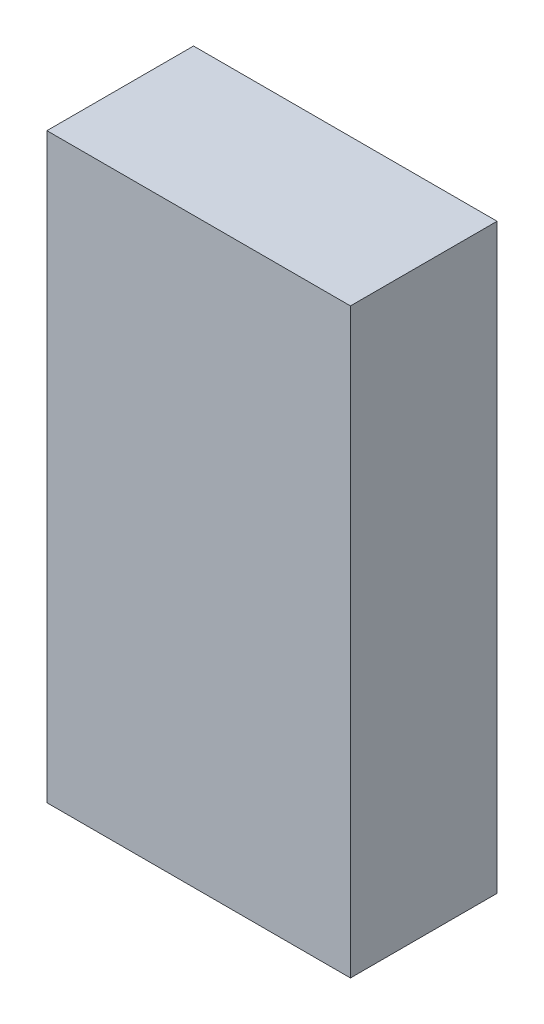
ISO-10303-21;
HEADER;
FILE_DESCRIPTION(('STEP AP214'),'2;1');
FILE_NAME('part.step','',(''),(''),'','','');
FILE_SCHEMA(('AUTOMOTIVE_DESIGN { 1 0 10303 214 1 1 1 1 }'));
ENDSEC;
DATA;
#1=APPLICATION_CONTEXT('core data for automotive mechanical design processes');
#2=APPLICATION_PROTOCOL_DEFINITION('international standard','automotive_design',2000,#1);
#3=PRODUCT_CONTEXT('',#1,'mechanical');
#4=PRODUCT('Part','Part','',(#3));
#5=PRODUCT_RELATED_PRODUCT_CATEGORY('part','',(#4));
#6=PRODUCT_DEFINITION_FORMATION('','',#4);
#7=PRODUCT_DEFINITION_CONTEXT('part definition',#1,'design');
#8=PRODUCT_DEFINITION('design','',#6,#7);
#9=PRODUCT_DEFINITION_SHAPE('','',#8);
#10=(LENGTH_UNIT() NAMED_UNIT(*) SI_UNIT(.MILLI.,.METRE.));
#11=(NAMED_UNIT(*) PLANE_ANGLE_UNIT() SI_UNIT($,.RADIAN.));
#12=(NAMED_UNIT(*) SI_UNIT($,.STERADIAN.) SOLID_ANGLE_UNIT());
#13=UNCERTAINTY_MEASURE_WITH_UNIT(LENGTH_MEASURE(1.E-05),#10,'distance_accuracy_value','');
#14=(GEOMETRIC_REPRESENTATION_CONTEXT(3) GLOBAL_UNCERTAINTY_ASSIGNED_CONTEXT((#13)) GLOBAL_UNIT_ASSIGNED_CONTEXT((#10,
#11,#12)) REPRESENTATION_CONTEXT('',''));
#15=CARTESIAN_POINT('',(0.,0.,0.));
#16=DIRECTION('',(0.,0.,1.));
#17=DIRECTION('',(1.,0.,0.));
#18=AXIS2_PLACEMENT_3D('',#15,#16,#17);
#19=CARTESIAN_POINT('',(719.701105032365,-1151.96925283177,0.));
#20=DIRECTION('',(0.,0.,-1.));
#21=DIRECTION('',(-1.,0.,0.));
#22=AXIS2_PLACEMENT_3D('',#19,#20,#21);
#23=PLANE('',#22);
#24=DIRECTION('',(0.,1.,0.));
#25=VECTOR('',#24,1.);
#26=CARTESIAN_POINT('',(719.701105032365,-1151.23265283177,0.));
#27=LINE('',#26,#25);
#28=CARTESIAN_POINT('',(719.701105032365,-1151.96925283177,0.));
#29=VERTEX_POINT('',#28);
#30=CARTESIAN_POINT('',(719.701105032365,-72.4960528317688,0.));
#31=VERTEX_POINT('',#30);
#32=EDGE_CURVE('E144',#29,#31,#27,.T.);
#33=ORIENTED_EDGE('',*,*,#32,.F.);
#34=DIRECTION('',(1.,0.,0.));
#35=VECTOR('',#34,1.);
#36=CARTESIAN_POINT('',(718.964505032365,-1151.96925283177,0.));
#37=LINE('',#36,#35);
#38=CARTESIAN_POINT('',(156.767905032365,-1151.96925283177,0.));
#39=VERTEX_POINT('',#38);
#40=EDGE_CURVE('E45',#39,#29,#37,.T.);
#41=ORIENTED_EDGE('',*,*,#40,.F.);
#42=DIRECTION('',(0.,-1.,0.));
#43=VECTOR('',#42,1.);
#44=CARTESIAN_POINT('',(156.767905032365,-1151.23265283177,0.));
#45=LINE('',#44,#43);
#46=CARTESIAN_POINT('',(156.767905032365,-72.4960528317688,0.));
#47=VERTEX_POINT('',#46);
#48=EDGE_CURVE('E148',#47,#39,#45,.T.);
#49=ORIENTED_EDGE('',*,*,#48,.F.);
#50=DIRECTION('',(-1.,0.,0.));
#51=VECTOR('',#50,1.);
#52=CARTESIAN_POINT('',(718.964505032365,-72.4960528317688,0.));
#53=LINE('',#52,#51);
#54=EDGE_CURVE('E94',#31,#47,#53,.T.);
#55=ORIENTED_EDGE('',*,*,#54,.F.);
#56=EDGE_LOOP('',(#33,#41,#49,#55));
#57=FACE_BOUND('',#56,.T.);
#58=DIRECTION('',(1.,0.,0.));
#59=VECTOR('',#58,1.);
#60=CARTESIAN_POINT('',(718.964505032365,-1151.23265283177,0.));
#61=LINE('',#60,#59);
#62=CARTESIAN_POINT('',(157.504505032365,-1151.23265283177,0.));
#63=VERTEX_POINT('',#62);
#64=CARTESIAN_POINT('',(718.964505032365,-1151.23265283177,0.));
#65=VERTEX_POINT('',#64);
#66=EDGE_CURVE('E121',#63,#65,#61,.T.);
#67=ORIENTED_EDGE('',*,*,#66,.T.);
#68=DIRECTION('',(0.,1.,0.));
#69=VECTOR('',#68,1.);
#70=CARTESIAN_POINT('',(718.964505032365,-1151.23265283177,0.));
#71=LINE('',#70,#69);
#72=CARTESIAN_POINT('',(718.964505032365,-73.2326528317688,0.));
#73=VERTEX_POINT('',#72);
#74=EDGE_CURVE('E37',#65,#73,#71,.T.);
#75=ORIENTED_EDGE('',*,*,#74,.T.);
#76=DIRECTION('',(-1.,0.,0.));
#77=VECTOR('',#76,1.);
#78=CARTESIAN_POINT('',(718.964505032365,-73.2326528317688,0.));
#79=LINE('',#78,#77);
#80=CARTESIAN_POINT('',(157.504505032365,-73.2326528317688,0.));
#81=VERTEX_POINT('',#80);
#82=EDGE_CURVE('E115',#73,#81,#79,.T.);
#83=ORIENTED_EDGE('',*,*,#82,.T.);
#84=DIRECTION('',(0.,-1.,0.));
#85=VECTOR('',#84,1.);
#86=CARTESIAN_POINT('',(157.504505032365,-1151.23265283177,0.));
#87=LINE('',#86,#85);
#88=EDGE_CURVE('E118',#81,#63,#87,.T.);
#89=ORIENTED_EDGE('',*,*,#88,.T.);
#90=EDGE_LOOP('',(#67,#75,#83,#89));
#91=FACE_BOUND('',#90,.T.);
#92=ADVANCED_FACE('F22',(#57,#91),#23,.T.);
#93=CARTESIAN_POINT('',(719.701105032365,-1151.23265283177,271.196193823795));
#94=DIRECTION('',(-1.,0.,0.));
#95=DIRECTION('',(0.,0.,1.));
#96=AXIS2_PLACEMENT_3D('',#93,#94,#95);
#97=PLANE('',#96);
#98=ORIENTED_EDGE('',*,*,#32,.T.);
#99=DIRECTION('',(0.,0.,-1.));
#100=VECTOR('',#99,1.);
#101=CARTESIAN_POINT('',(719.701105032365,-72.4960528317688,271.196193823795));
#102=LINE('',#101,#100);
#103=CARTESIAN_POINT('',(719.701105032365,-72.4960528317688,271.932793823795));
#104=VERTEX_POINT('',#103);
#105=EDGE_CURVE('E11',#104,#31,#102,.T.);
#106=ORIENTED_EDGE('',*,*,#105,.F.);
#107=DIRECTION('',(0.,1.,0.));
#108=VECTOR('',#107,1.);
#109=CARTESIAN_POINT('',(719.701105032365,-1151.96925283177,271.932793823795));
#110=LINE('',#109,#108);
#111=CARTESIAN_POINT('',(719.701105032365,-1151.96925283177,271.932793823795));
#112=VERTEX_POINT('',#111);
#113=EDGE_CURVE('E109',#112,#104,#110,.T.);
#114=ORIENTED_EDGE('',*,*,#113,.F.);
#115=DIRECTION('',(0.,0.,-1.));
#116=VECTOR('',#115,1.);
#117=CARTESIAN_POINT('',(719.701105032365,-1151.96925283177,271.196193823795));
#118=LINE('',#117,#116);
#119=EDGE_CURVE('E151',#112,#29,#118,.T.);
#120=ORIENTED_EDGE('',*,*,#119,.T.);
#121=EDGE_LOOP('',(#98,#106,#114,#120));
#122=FACE_BOUND('',#121,.T.);
#123=ADVANCED_FACE('F24',(#122),#97,.F.);
#124=CARTESIAN_POINT('',(718.964505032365,-72.4960528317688,271.196193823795));
#125=DIRECTION('',(0.,-1.,0.));
#126=DIRECTION('',(1.,0.,0.));
#127=AXIS2_PLACEMENT_3D('',#124,#125,#126);
#128=PLANE('',#127);
#129=ORIENTED_EDGE('',*,*,#54,.T.);
#130=DIRECTION('',(0.,0.,-1.));
#131=VECTOR('',#130,1.);
#132=CARTESIAN_POINT('',(156.767905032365,-72.4960528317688,271.196193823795));
#133=LINE('',#132,#131);
#134=CARTESIAN_POINT('',(156.767905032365,-72.4960528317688,271.932793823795));
#135=VERTEX_POINT('',#134);
#136=EDGE_CURVE('E30',#135,#47,#133,.T.);
#137=ORIENTED_EDGE('',*,*,#136,.F.);
#138=DIRECTION('',(-1.,0.,0.));
#139=VECTOR('',#138,1.);
#140=CARTESIAN_POINT('',(719.701105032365,-72.4960528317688,271.932793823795));
#141=LINE('',#140,#139);
#142=EDGE_CURVE('E93',#104,#135,#141,.T.);
#143=ORIENTED_EDGE('',*,*,#142,.F.);
#144=ORIENTED_EDGE('',*,*,#105,.T.);
#145=EDGE_LOOP('',(#129,#137,#143,#144));
#146=FACE_BOUND('',#145,.T.);
#147=ADVANCED_FACE('F91',(#146),#128,.F.);
#148=CARTESIAN_POINT('',(156.767905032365,-1151.23265283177,271.196193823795));
#149=DIRECTION('',(1.,0.,0.));
#150=DIRECTION('',(0.,0.,-1.));
#151=AXIS2_PLACEMENT_3D('',#148,#149,#150);
#152=PLANE('',#151);
#153=ORIENTED_EDGE('',*,*,#48,.T.);
#154=DIRECTION('',(0.,0.,-1.));
#155=VECTOR('',#154,1.);
#156=CARTESIAN_POINT('',(156.767905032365,-1151.96925283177,271.196193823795));
#157=LINE('',#156,#155);
#158=CARTESIAN_POINT('',(156.767905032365,-1151.96925283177,271.932793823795));
#159=VERTEX_POINT('',#158);
#160=EDGE_CURVE('E97',#159,#39,#157,.T.);
#161=ORIENTED_EDGE('',*,*,#160,.F.);
#162=DIRECTION('',(0.,-1.,0.));
#163=VECTOR('',#162,1.);
#164=CARTESIAN_POINT('',(156.767905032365,-72.4960528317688,271.932793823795));
#165=LINE('',#164,#163);
#166=EDGE_CURVE('E99',#135,#159,#165,.T.);
#167=ORIENTED_EDGE('',*,*,#166,.F.);
#168=ORIENTED_EDGE('',*,*,#136,.T.);
#169=EDGE_LOOP('',(#153,#161,#167,#168));
#170=FACE_BOUND('',#169,.T.);
#171=ADVANCED_FACE('F100',(#170),#152,.F.);
#172=CARTESIAN_POINT('',(718.964505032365,-1151.96925283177,271.196193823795));
#173=DIRECTION('',(0.,1.,0.));
#174=DIRECTION('',(0.,0.,1.));
#175=AXIS2_PLACEMENT_3D('',#172,#173,#174);
#176=PLANE('',#175);
#177=ORIENTED_EDGE('',*,*,#40,.T.);
#178=ORIENTED_EDGE('',*,*,#119,.F.);
#179=DIRECTION('',(1.,0.,0.));
#180=VECTOR('',#179,1.);
#181=CARTESIAN_POINT('',(156.767905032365,-1151.96925283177,271.932793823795));
#182=LINE('',#181,#180);
#183=EDGE_CURVE('E104',#159,#112,#182,.T.);
#184=ORIENTED_EDGE('',*,*,#183,.F.);
#185=ORIENTED_EDGE('',*,*,#160,.T.);
#186=EDGE_LOOP('',(#177,#178,#184,#185));
#187=FACE_BOUND('',#186,.T.);
#188=ADVANCED_FACE('F153',(#187),#176,.F.);
#189=CARTESIAN_POINT('',(718.964505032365,-1151.23265283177,271.196193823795));
#190=DIRECTION('',(-1.,0.,0.));
#191=DIRECTION('',(0.,0.,1.));
#192=AXIS2_PLACEMENT_3D('',#189,#190,#191);
#193=PLANE('',#192);
#194=ORIENTED_EDGE('',*,*,#74,.F.);
#195=DIRECTION('',(0.,0.,-1.));
#196=VECTOR('',#195,1.);
#197=CARTESIAN_POINT('',(718.964505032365,-1151.23265283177,271.196193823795));
#198=LINE('',#197,#196);
#199=CARTESIAN_POINT('',(718.964505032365,-1151.23265283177,271.196193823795));
#200=VERTEX_POINT('',#199);
#201=EDGE_CURVE('E136',#200,#65,#198,.T.);
#202=ORIENTED_EDGE('',*,*,#201,.F.);
#203=DIRECTION('',(0.,1.,0.));
#204=VECTOR('',#203,1.);
#205=CARTESIAN_POINT('',(718.964505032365,-1151.23265283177,271.196193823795));
#206=LINE('',#205,#204);
#207=CARTESIAN_POINT('',(718.964505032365,-73.2326528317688,271.196193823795));
#208=VERTEX_POINT('',#207);
#209=EDGE_CURVE('E124',#200,#208,#206,.T.);
#210=ORIENTED_EDGE('',*,*,#209,.T.);
#211=DIRECTION('',(0.,0.,-1.));
#212=VECTOR('',#211,1.);
#213=CARTESIAN_POINT('',(718.964505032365,-73.2326528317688,271.196193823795));
#214=LINE('',#213,#212);
#215=EDGE_CURVE('E142',#208,#73,#214,.T.);
#216=ORIENTED_EDGE('',*,*,#215,.T.);
#217=EDGE_LOOP('',(#194,#202,#210,#216));
#218=FACE_BOUND('',#217,.T.);
#219=ADVANCED_FACE('F170',(#218),#193,.T.);
#220=CARTESIAN_POINT('',(718.964505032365,-73.2326528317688,271.196193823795));
#221=DIRECTION('',(0.,-1.,0.));
#222=DIRECTION('',(1.,0.,0.));
#223=AXIS2_PLACEMENT_3D('',#220,#221,#222);
#224=PLANE('',#223);
#225=ORIENTED_EDGE('',*,*,#82,.F.);
#226=ORIENTED_EDGE('',*,*,#215,.F.);
#227=DIRECTION('',(-1.,0.,0.));
#228=VECTOR('',#227,1.);
#229=CARTESIAN_POINT('',(718.964505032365,-73.2326528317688,271.196193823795));
#230=LINE('',#229,#228);
#231=CARTESIAN_POINT('',(157.504505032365,-73.2326528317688,271.196193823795));
#232=VERTEX_POINT('',#231);
#233=EDGE_CURVE('E127',#208,#232,#230,.T.);
#234=ORIENTED_EDGE('',*,*,#233,.T.);
#235=DIRECTION('',(0.,0.,-1.));
#236=VECTOR('',#235,1.);
#237=CARTESIAN_POINT('',(157.504505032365,-73.2326528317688,271.196193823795));
#238=LINE('',#237,#236);
#239=EDGE_CURVE('E140',#232,#81,#238,.T.);
#240=ORIENTED_EDGE('',*,*,#239,.T.);
#241=EDGE_LOOP('',(#225,#226,#234,#240));
#242=FACE_BOUND('',#241,.T.);
#243=ADVANCED_FACE('F205',(#242),#224,.T.);
#244=CARTESIAN_POINT('',(157.504505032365,-1151.23265283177,271.196193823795));
#245=DIRECTION('',(1.,0.,0.));
#246=DIRECTION('',(0.,0.,-1.));
#247=AXIS2_PLACEMENT_3D('',#244,#245,#246);
#248=PLANE('',#247);
#249=ORIENTED_EDGE('',*,*,#88,.F.);
#250=ORIENTED_EDGE('',*,*,#239,.F.);
#251=DIRECTION('',(0.,-1.,0.));
#252=VECTOR('',#251,1.);
#253=CARTESIAN_POINT('',(157.504505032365,-1151.23265283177,271.196193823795));
#254=LINE('',#253,#252);
#255=CARTESIAN_POINT('',(157.504505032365,-1151.23265283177,271.196193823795));
#256=VERTEX_POINT('',#255);
#257=EDGE_CURVE('E130',#232,#256,#254,.T.);
#258=ORIENTED_EDGE('',*,*,#257,.T.);
#259=DIRECTION('',(0.,0.,-1.));
#260=VECTOR('',#259,1.);
#261=CARTESIAN_POINT('',(157.504505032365,-1151.23265283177,271.196193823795));
#262=LINE('',#261,#260);
#263=EDGE_CURVE('E138',#256,#63,#262,.T.);
#264=ORIENTED_EDGE('',*,*,#263,.T.);
#265=EDGE_LOOP('',(#249,#250,#258,#264));
#266=FACE_BOUND('',#265,.T.);
#267=ADVANCED_FACE('F202',(#266),#248,.T.);
#268=CARTESIAN_POINT('',(718.964505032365,-1151.23265283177,271.196193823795));
#269=DIRECTION('',(0.,1.,0.));
#270=DIRECTION('',(0.,0.,1.));
#271=AXIS2_PLACEMENT_3D('',#268,#269,#270);
#272=PLANE('',#271);
#273=ORIENTED_EDGE('',*,*,#66,.F.);
#274=ORIENTED_EDGE('',*,*,#263,.F.);
#275=DIRECTION('',(1.,0.,0.));
#276=VECTOR('',#275,1.);
#277=CARTESIAN_POINT('',(718.964505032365,-1151.23265283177,271.196193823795));
#278=LINE('',#277,#276);
#279=EDGE_CURVE('E133',#256,#200,#278,.T.);
#280=ORIENTED_EDGE('',*,*,#279,.T.);
#281=ORIENTED_EDGE('',*,*,#201,.T.);
#282=EDGE_LOOP('',(#273,#274,#280,#281));
#283=FACE_BOUND('',#282,.T.);
#284=ADVANCED_FACE('F194',(#283),#272,.T.);
#285=CARTESIAN_POINT('',(156.767905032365,-72.4960528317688,271.196193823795));
#286=DIRECTION('',(0.,0.,1.));
#287=DIRECTION('',(1.,0.,0.));
#288=AXIS2_PLACEMENT_3D('',#285,#286,#287);
#289=PLANE('',#288);
#290=ORIENTED_EDGE('',*,*,#209,.F.);
#291=ORIENTED_EDGE('',*,*,#279,.F.);
#292=ORIENTED_EDGE('',*,*,#257,.F.);
#293=ORIENTED_EDGE('',*,*,#233,.F.);
#294=EDGE_LOOP('',(#290,#291,#292,#293));
#295=FACE_BOUND('',#294,.T.);
#296=ADVANCED_FACE('F190',(#295),#289,.F.);
#297=CARTESIAN_POINT('',(156.767905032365,-72.4960528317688,271.932793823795));
#298=DIRECTION('',(0.,0.,1.));
#299=DIRECTION('',(1.,0.,0.));
#300=AXIS2_PLACEMENT_3D('',#297,#298,#299);
#301=PLANE('',#300);
#302=ORIENTED_EDGE('',*,*,#142,.T.);
#303=ORIENTED_EDGE('',*,*,#166,.T.);
#304=ORIENTED_EDGE('',*,*,#183,.T.);
#305=ORIENTED_EDGE('',*,*,#113,.T.);
#306=EDGE_LOOP('',(#302,#303,#304,#305));
#307=FACE_BOUND('',#306,.T.);
#308=ADVANCED_FACE('F107',(#307),#301,.T.);
#309=CLOSED_SHELL('',(#92,#123,#147,#171,#188,#219,#243,#267,#284,#296,#308));
#310=MANIFOLD_SOLID_BREP('B2',#309);
#311=ADVANCED_BREP_SHAPE_REPRESENTATION('',(#18,#310),#14);
#312=SHAPE_DEFINITION_REPRESENTATION(#9,#311);
ENDSEC;
END-ISO-10303-21;
